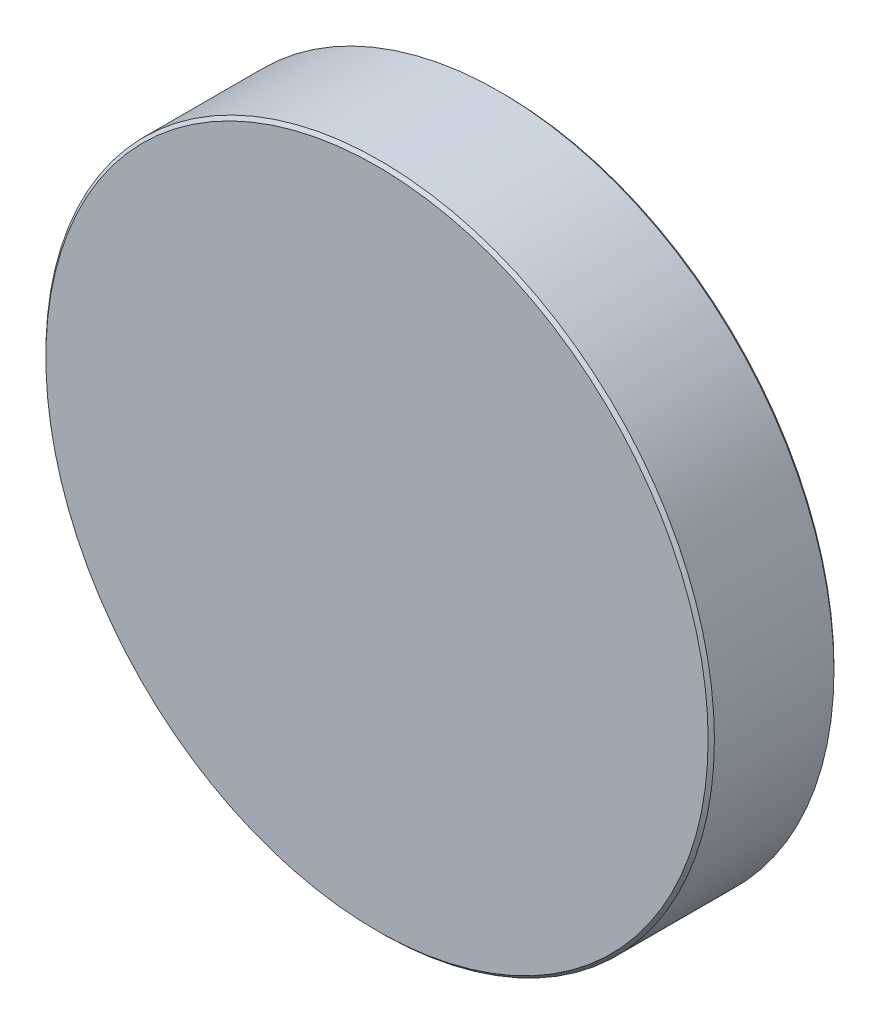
from build123d import *

# Parameters (mm, degrees)
SKETCH1_R     = 26.9875
WINDOW_DEPTH  = 10.16
CHAMFER1_SIZE = 0.254


with BuildPart() as part:
    # Sketch1 → window (new body)
    with BuildSketch(Plane.XY):
        Circle(SKETCH1_R)
    extrude(amount=WINDOW_DEPTH)

    # Chamfer1
    chamfer1_edges = [part.edges().sort_by_distance(p)[0] for p in [
        (-26.9875, 0, 0),
        (-26.9875, 0, 10.16),
    ]]
    chamfer(chamfer1_edges, length=CHAMFER1_SIZE)


solid = part.part
